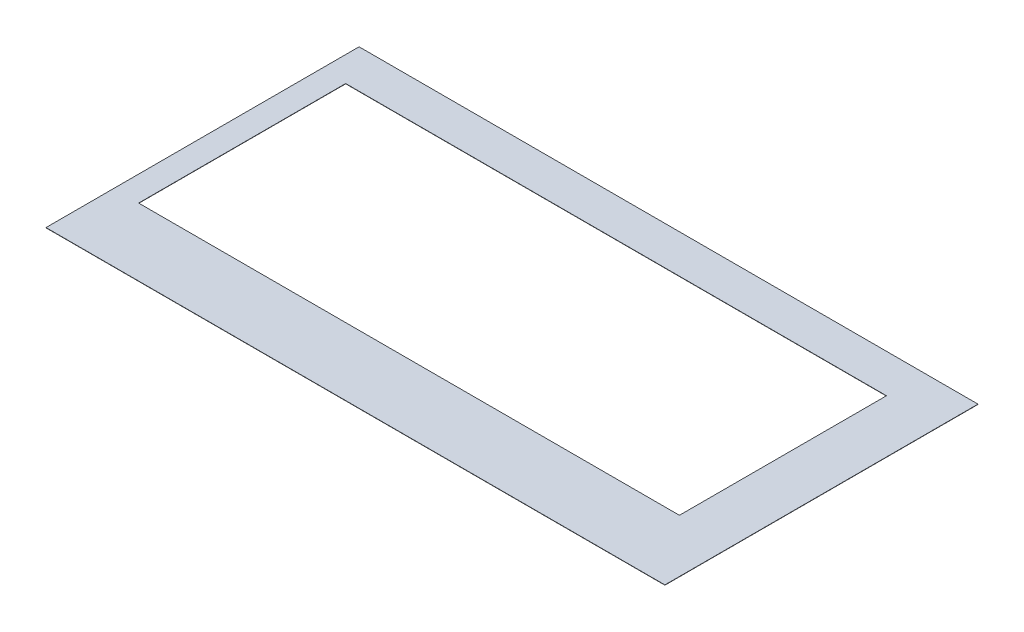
ISO-10303-21;
HEADER;
FILE_DESCRIPTION(('STEP AP214'),'2;1');
FILE_NAME('part.step','',(''),(''),'','','');
FILE_SCHEMA(('AUTOMOTIVE_DESIGN { 1 0 10303 214 1 1 1 1 }'));
ENDSEC;
DATA;
#1=APPLICATION_CONTEXT('core data for automotive mechanical design processes');
#2=APPLICATION_PROTOCOL_DEFINITION('international standard','automotive_design',2000,#1);
#3=PRODUCT_CONTEXT('',#1,'mechanical');
#4=PRODUCT('Part','Part','',(#3));
#5=PRODUCT_RELATED_PRODUCT_CATEGORY('part','',(#4));
#6=PRODUCT_DEFINITION_FORMATION('','',#4);
#7=PRODUCT_DEFINITION_CONTEXT('part definition',#1,'design');
#8=PRODUCT_DEFINITION('design','',#6,#7);
#9=PRODUCT_DEFINITION_SHAPE('','',#8);
#10=(LENGTH_UNIT() NAMED_UNIT(*) SI_UNIT(.MILLI.,.METRE.));
#11=(NAMED_UNIT(*) PLANE_ANGLE_UNIT() SI_UNIT($,.RADIAN.));
#12=(NAMED_UNIT(*) SI_UNIT($,.STERADIAN.) SOLID_ANGLE_UNIT());
#13=UNCERTAINTY_MEASURE_WITH_UNIT(LENGTH_MEASURE(1.E-05),#10,'distance_accuracy_value','');
#14=(GEOMETRIC_REPRESENTATION_CONTEXT(3) GLOBAL_UNCERTAINTY_ASSIGNED_CONTEXT((#13)) GLOBAL_UNIT_ASSIGNED_CONTEXT((#10,
#11,#12)) REPRESENTATION_CONTEXT('',''));
#15=CARTESIAN_POINT('',(0.,0.,0.));
#16=DIRECTION('',(0.,0.,1.));
#17=DIRECTION('',(1.,0.,0.));
#18=AXIS2_PLACEMENT_3D('',#15,#16,#17);
#19=CARTESIAN_POINT('',(0.,0.05,0.));
#20=DIRECTION('',(0.,1.,0.));
#21=DIRECTION('',(0.,0.,1.));
#22=AXIS2_PLACEMENT_3D('',#19,#20,#21);
#23=PLANE('',#22);
#24=DIRECTION('',(1.,0.,0.));
#25=VECTOR('',#24,1.);
#26=CARTESIAN_POINT('',(0.,0.05,0.));
#27=LINE('',#26,#25);
#28=CARTESIAN_POINT('',(-1.39999999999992,0.05,0.));
#29=VERTEX_POINT('',#28);
#30=CARTESIAN_POINT('',(109.5,0.05,0.));
#31=VERTEX_POINT('',#30);
#32=EDGE_CURVE('E134',#29,#31,#27,.T.);
#33=ORIENTED_EDGE('',*,*,#32,.T.);
#34=DIRECTION('',(0.,0.,-1.));
#35=VECTOR('',#34,1.);
#36=CARTESIAN_POINT('',(109.5,0.05,0.));
#37=LINE('',#36,#35);
#38=CARTESIAN_POINT('',(109.5,0.05,-56.1));
#39=VERTEX_POINT('',#38);
#40=EDGE_CURVE('E136',#31,#39,#37,.T.);
#41=ORIENTED_EDGE('',*,*,#40,.T.);
#42=DIRECTION('',(-1.,0.,0.));
#43=VECTOR('',#42,1.);
#44=CARTESIAN_POINT('',(0.,0.05,-56.1));
#45=LINE('',#44,#43);
#46=CARTESIAN_POINT('',(-1.39999999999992,0.05,-56.1000000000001));
#47=VERTEX_POINT('',#46);
#48=EDGE_CURVE('E139',#39,#47,#45,.T.);
#49=ORIENTED_EDGE('',*,*,#48,.T.);
#50=DIRECTION('',(0.,0.,1.));
#51=VECTOR('',#50,1.);
#52=CARTESIAN_POINT('',(-1.39999999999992,0.05,-56.1000000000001));
#53=LINE('',#52,#51);
#54=EDGE_CURVE('E141',#47,#29,#53,.T.);
#55=ORIENTED_EDGE('',*,*,#54,.T.);
#56=EDGE_LOOP('',(#33,#41,#49,#55));
#57=FACE_BOUND('',#56,.T.);
#58=DIRECTION('',(1.,0.,0.));
#59=VECTOR('',#58,1.);
#60=CARTESIAN_POINT('',(3.10000000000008,0.05,-12.1));
#61=LINE('',#60,#59);
#62=CARTESIAN_POINT('',(3.10000000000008,0.05,-12.1));
#63=VERTEX_POINT('',#62);
#64=CARTESIAN_POINT('',(100.,0.05,-12.1));
#65=VERTEX_POINT('',#64);
#66=EDGE_CURVE('E106',#63,#65,#61,.T.);
#67=ORIENTED_EDGE('',*,*,#66,.F.);
#68=DIRECTION('',(0.,0.,1.));
#69=VECTOR('',#68,1.);
#70=CARTESIAN_POINT('',(3.10000000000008,0.05,-12.1));
#71=LINE('',#70,#69);
#72=CARTESIAN_POINT('',(3.10000000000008,0.05,-49.2));
#73=VERTEX_POINT('',#72);
#74=EDGE_CURVE('E98',#73,#63,#71,.T.);
#75=ORIENTED_EDGE('',*,*,#74,.F.);
#76=DIRECTION('',(-1.,0.,0.));
#77=VECTOR('',#76,1.);
#78=CARTESIAN_POINT('',(3.10000000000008,0.05,-49.2));
#79=LINE('',#78,#77);
#80=CARTESIAN_POINT('',(100.,0.05,-49.2));
#81=VERTEX_POINT('',#80);
#82=EDGE_CURVE('E120',#81,#73,#79,.T.);
#83=ORIENTED_EDGE('',*,*,#82,.F.);
#84=DIRECTION('',(0.,0.,-1.));
#85=VECTOR('',#84,1.);
#86=CARTESIAN_POINT('',(100.,0.05,-12.1));
#87=LINE('',#86,#85);
#88=EDGE_CURVE('E118',#65,#81,#87,.T.);
#89=ORIENTED_EDGE('',*,*,#88,.F.);
#90=EDGE_LOOP('',(#67,#75,#83,#89));
#91=FACE_BOUND('',#90,.T.);
#92=ADVANCED_FACE('F33',(#57,#91),#23,.T.);
#93=CARTESIAN_POINT('',(0.,0.,0.));
#94=DIRECTION('',(0.,1.,0.));
#95=DIRECTION('',(0.,0.,1.));
#96=AXIS2_PLACEMENT_3D('',#93,#94,#95);
#97=PLANE('',#96);
#98=DIRECTION('',(1.,0.,0.));
#99=VECTOR('',#98,1.);
#100=CARTESIAN_POINT('',(0.,0.,0.));
#101=LINE('',#100,#99);
#102=CARTESIAN_POINT('',(-1.39999999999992,0.,0.));
#103=VERTEX_POINT('',#102);
#104=CARTESIAN_POINT('',(109.5,0.,0.));
#105=VERTEX_POINT('',#104);
#106=EDGE_CURVE('E114',#103,#105,#101,.T.);
#107=ORIENTED_EDGE('',*,*,#106,.F.);
#108=DIRECTION('',(0.,0.,1.));
#109=VECTOR('',#108,1.);
#110=CARTESIAN_POINT('',(-1.39999999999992,0.,-56.1000000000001));
#111=LINE('',#110,#109);
#112=CARTESIAN_POINT('',(-1.39999999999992,0.,-56.1000000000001));
#113=VERTEX_POINT('',#112);
#114=EDGE_CURVE('E137',#113,#103,#111,.T.);
#115=ORIENTED_EDGE('',*,*,#114,.F.);
#116=DIRECTION('',(-1.,0.,0.));
#117=VECTOR('',#116,1.);
#118=CARTESIAN_POINT('',(-1.39999999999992,0.,-56.1000000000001));
#119=LINE('',#118,#117);
#120=CARTESIAN_POINT('',(109.5,0.,-56.1));
#121=VERTEX_POINT('',#120);
#122=EDGE_CURVE('E148',#121,#113,#119,.T.);
#123=ORIENTED_EDGE('',*,*,#122,.F.);
#124=DIRECTION('',(0.,0.,-1.));
#125=VECTOR('',#124,1.);
#126=CARTESIAN_POINT('',(109.5,0.,0.));
#127=LINE('',#126,#125);
#128=EDGE_CURVE('E145',#105,#121,#127,.T.);
#129=ORIENTED_EDGE('',*,*,#128,.F.);
#130=EDGE_LOOP('',(#107,#115,#123,#129));
#131=FACE_BOUND('',#130,.T.);
#132=DIRECTION('',(0.,0.,1.));
#133=VECTOR('',#132,1.);
#134=CARTESIAN_POINT('',(3.10000000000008,0.,-12.1));
#135=LINE('',#134,#133);
#136=CARTESIAN_POINT('',(3.10000000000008,0.,-49.2));
#137=VERTEX_POINT('',#136);
#138=CARTESIAN_POINT('',(3.10000000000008,0.,-12.1));
#139=VERTEX_POINT('',#138);
#140=EDGE_CURVE('E56',#137,#139,#135,.T.);
#141=ORIENTED_EDGE('',*,*,#140,.T.);
#142=DIRECTION('',(1.,0.,0.));
#143=VECTOR('',#142,1.);
#144=CARTESIAN_POINT('',(3.10000000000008,0.,-12.1));
#145=LINE('',#144,#143);
#146=CARTESIAN_POINT('',(100.,0.,-12.1));
#147=VERTEX_POINT('',#146);
#148=EDGE_CURVE('E113',#139,#147,#145,.T.);
#149=ORIENTED_EDGE('',*,*,#148,.T.);
#150=DIRECTION('',(0.,0.,-1.));
#151=VECTOR('',#150,1.);
#152=CARTESIAN_POINT('',(100.,0.,-12.1));
#153=LINE('',#152,#151);
#154=CARTESIAN_POINT('',(100.,0.,-49.2));
#155=VERTEX_POINT('',#154);
#156=EDGE_CURVE('E126',#147,#155,#153,.T.);
#157=ORIENTED_EDGE('',*,*,#156,.T.);
#158=DIRECTION('',(-1.,0.,0.));
#159=VECTOR('',#158,1.);
#160=CARTESIAN_POINT('',(3.10000000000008,0.,-49.2));
#161=LINE('',#160,#159);
#162=EDGE_CURVE('E107',#155,#137,#161,.T.);
#163=ORIENTED_EDGE('',*,*,#162,.T.);
#164=EDGE_LOOP('',(#141,#149,#157,#163));
#165=FACE_BOUND('',#164,.T.);
#166=ADVANCED_FACE('F168',(#131,#165),#97,.F.);
#167=CARTESIAN_POINT('',(0.,0.05,0.));
#168=DIRECTION('',(0.,0.,-1.));
#169=DIRECTION('',(-1.,0.,0.));
#170=AXIS2_PLACEMENT_3D('',#167,#168,#169);
#171=PLANE('',#170);
#172=ORIENTED_EDGE('',*,*,#106,.T.);
#173=DIRECTION('',(0.,-1.,0.));
#174=VECTOR('',#173,1.);
#175=CARTESIAN_POINT('',(109.5,0.05,0.));
#176=LINE('',#175,#174);
#177=EDGE_CURVE('E11',#31,#105,#176,.T.);
#178=ORIENTED_EDGE('',*,*,#177,.F.);
#179=ORIENTED_EDGE('',*,*,#32,.F.);
#180=DIRECTION('',(0.,-1.,0.));
#181=VECTOR('',#180,1.);
#182=CARTESIAN_POINT('',(-1.39999999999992,0.05,0.));
#183=LINE('',#182,#181);
#184=EDGE_CURVE('E143',#29,#103,#183,.T.);
#185=ORIENTED_EDGE('',*,*,#184,.T.);
#186=EDGE_LOOP('',(#172,#178,#179,#185));
#187=FACE_BOUND('',#186,.T.);
#188=ADVANCED_FACE('F35',(#187),#171,.F.);
#189=CARTESIAN_POINT('',(109.5,0.05,0.));
#190=DIRECTION('',(-1.,0.,0.));
#191=DIRECTION('',(0.,0.,1.));
#192=AXIS2_PLACEMENT_3D('',#189,#190,#191);
#193=PLANE('',#192);
#194=ORIENTED_EDGE('',*,*,#128,.T.);
#195=DIRECTION('',(0.,-1.,0.));
#196=VECTOR('',#195,1.);
#197=CARTESIAN_POINT('',(109.5,0.05,-56.1));
#198=LINE('',#197,#196);
#199=EDGE_CURVE('E41',#39,#121,#198,.T.);
#200=ORIENTED_EDGE('',*,*,#199,.F.);
#201=ORIENTED_EDGE('',*,*,#40,.F.);
#202=ORIENTED_EDGE('',*,*,#177,.T.);
#203=EDGE_LOOP('',(#194,#200,#201,#202));
#204=FACE_BOUND('',#203,.T.);
#205=ADVANCED_FACE('F164',(#204),#193,.F.);
#206=CARTESIAN_POINT('',(-1.39999999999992,0.05,-56.1000000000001));
#207=DIRECTION('',(0.,0.,1.));
#208=DIRECTION('',(1.,0.,0.));
#209=AXIS2_PLACEMENT_3D('',#206,#207,#208);
#210=PLANE('',#209);
#211=ORIENTED_EDGE('',*,*,#122,.T.);
#212=DIRECTION('',(0.,-1.,0.));
#213=VECTOR('',#212,1.);
#214=CARTESIAN_POINT('',(-1.39999999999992,0.05,-56.1000000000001));
#215=LINE('',#214,#213);
#216=EDGE_CURVE('E154',#47,#113,#215,.T.);
#217=ORIENTED_EDGE('',*,*,#216,.F.);
#218=ORIENTED_EDGE('',*,*,#48,.F.);
#219=ORIENTED_EDGE('',*,*,#199,.T.);
#220=EDGE_LOOP('',(#211,#217,#218,#219));
#221=FACE_BOUND('',#220,.T.);
#222=ADVANCED_FACE('F160',(#221),#210,.F.);
#223=CARTESIAN_POINT('',(-1.39999999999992,0.05,-56.1000000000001));
#224=DIRECTION('',(1.,0.,0.));
#225=DIRECTION('',(0.,0.,-1.));
#226=AXIS2_PLACEMENT_3D('',#223,#224,#225);
#227=PLANE('',#226);
#228=ORIENTED_EDGE('',*,*,#114,.T.);
#229=ORIENTED_EDGE('',*,*,#184,.F.);
#230=ORIENTED_EDGE('',*,*,#54,.F.);
#231=ORIENTED_EDGE('',*,*,#216,.T.);
#232=EDGE_LOOP('',(#228,#229,#230,#231));
#233=FACE_BOUND('',#232,.T.);
#234=ADVANCED_FACE('F173',(#233),#227,.F.);
#235=CARTESIAN_POINT('',(3.10000000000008,0.05,-12.1));
#236=DIRECTION('',(1.,0.,0.));
#237=DIRECTION('',(0.,0.,-1.));
#238=AXIS2_PLACEMENT_3D('',#235,#236,#237);
#239=PLANE('',#238);
#240=ORIENTED_EDGE('',*,*,#140,.F.);
#241=DIRECTION('',(0.,-1.,0.));
#242=VECTOR('',#241,1.);
#243=CARTESIAN_POINT('',(3.10000000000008,0.05,-49.2));
#244=LINE('',#243,#242);
#245=EDGE_CURVE('E102',#73,#137,#244,.T.);
#246=ORIENTED_EDGE('',*,*,#245,.F.);
#247=ORIENTED_EDGE('',*,*,#74,.T.);
#248=DIRECTION('',(0.,-1.,0.));
#249=VECTOR('',#248,1.);
#250=CARTESIAN_POINT('',(3.10000000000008,0.05,-12.1));
#251=LINE('',#250,#249);
#252=EDGE_CURVE('E101',#63,#139,#251,.T.);
#253=ORIENTED_EDGE('',*,*,#252,.T.);
#254=EDGE_LOOP('',(#240,#246,#247,#253));
#255=FACE_BOUND('',#254,.T.);
#256=ADVANCED_FACE('F100',(#255),#239,.T.);
#257=CARTESIAN_POINT('',(3.10000000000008,0.05,-12.1));
#258=DIRECTION('',(0.,0.,-1.));
#259=DIRECTION('',(-1.,0.,0.));
#260=AXIS2_PLACEMENT_3D('',#257,#258,#259);
#261=PLANE('',#260);
#262=ORIENTED_EDGE('',*,*,#148,.F.);
#263=ORIENTED_EDGE('',*,*,#252,.F.);
#264=ORIENTED_EDGE('',*,*,#66,.T.);
#265=DIRECTION('',(0.,-1.,0.));
#266=VECTOR('',#265,1.);
#267=CARTESIAN_POINT('',(100.,0.05,-12.1));
#268=LINE('',#267,#266);
#269=EDGE_CURVE('E115',#65,#147,#268,.T.);
#270=ORIENTED_EDGE('',*,*,#269,.T.);
#271=EDGE_LOOP('',(#262,#263,#264,#270));
#272=FACE_BOUND('',#271,.T.);
#273=ADVANCED_FACE('F110',(#272),#261,.T.);
#274=CARTESIAN_POINT('',(100.,0.05,-12.1));
#275=DIRECTION('',(-1.,0.,0.));
#276=DIRECTION('',(0.,0.,1.));
#277=AXIS2_PLACEMENT_3D('',#274,#275,#276);
#278=PLANE('',#277);
#279=ORIENTED_EDGE('',*,*,#156,.F.);
#280=ORIENTED_EDGE('',*,*,#269,.F.);
#281=ORIENTED_EDGE('',*,*,#88,.T.);
#282=DIRECTION('',(0.,-1.,0.));
#283=VECTOR('',#282,1.);
#284=CARTESIAN_POINT('',(100.,0.05,-49.2));
#285=LINE('',#284,#283);
#286=EDGE_CURVE('E48',#81,#155,#285,.T.);
#287=ORIENTED_EDGE('',*,*,#286,.T.);
#288=EDGE_LOOP('',(#279,#280,#281,#287));
#289=FACE_BOUND('',#288,.T.);
#290=ADVANCED_FACE('F242',(#289),#278,.T.);
#291=CARTESIAN_POINT('',(3.10000000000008,0.05,-49.2));
#292=DIRECTION('',(0.,0.,1.));
#293=DIRECTION('',(1.,0.,0.));
#294=AXIS2_PLACEMENT_3D('',#291,#292,#293);
#295=PLANE('',#294);
#296=ORIENTED_EDGE('',*,*,#162,.F.);
#297=ORIENTED_EDGE('',*,*,#286,.F.);
#298=ORIENTED_EDGE('',*,*,#82,.T.);
#299=ORIENTED_EDGE('',*,*,#245,.T.);
#300=EDGE_LOOP('',(#296,#297,#298,#299));
#301=FACE_BOUND('',#300,.T.);
#302=ADVANCED_FACE('F249',(#301),#295,.T.);
#303=CLOSED_SHELL('',(#92,#166,#188,#205,#222,#234,#256,#273,#290,#302));
#304=MANIFOLD_SOLID_BREP('B2',#303);
#305=ADVANCED_BREP_SHAPE_REPRESENTATION('',(#18,#304),#14);
#306=SHAPE_DEFINITION_REPRESENTATION(#9,#305);
ENDSEC;
END-ISO-10303-21;
